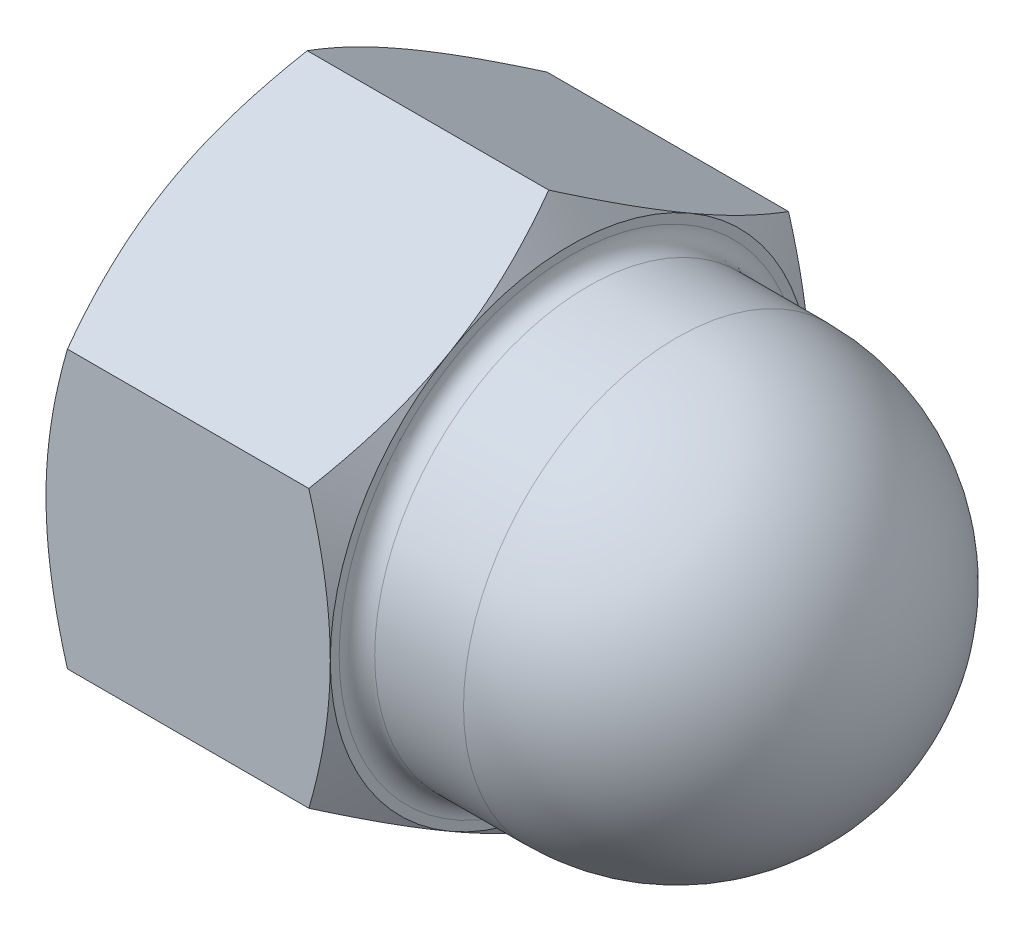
from build123d import *

# Parameters (mm, degrees)
BASENUT_DEPTH = 16
GRVSKE_W      = 7
GRVSKE_H      = 2.75
DOMEFILLET_R  = 1


with BuildPart() as part:
    # BaseNutSke → BaseNut (new body)
    with BuildSketch(Plane(origin=(0, 0, 0), x_dir=(0, 0, -1), z_dir=(1, 0, 0))):
        Polygon((13.5, 7.794228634), (13.5, -7.794228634), (0, -15.588457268), (-13.5, -7.794228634), (-13.5, 7.794228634), (0, 15.588457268), align=None)
    extrude(amount=BASENUT_DEPTH)

    # DomeSke → Dome (revolve)
    with BuildSketch(Plane.XY):
        with BuildLine():
            Line((34, 0), (0, 0))
            Line((0, 0), (0, 12))
            Line((0, 12), (22, 12))
            ThreePointArc((22, 12), (30.485281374, 8.485281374), (34, 0))
        make_face()
    revolve(axis=Axis((0, 0, 0), (1, 0, 0)))

    # Sketch4 → DoubleChamfer (revolve, cut)
    with BuildSketch(Plane.XY, mode=Mode.PRIVATE) as doublechamfer_sk:
        Polygon((0, 13.5), (2.504809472, 17.838457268), (13.495190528, 17.838457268), (16, 13.5), (18, 13.5), (18, 28.5), (-2, 28.5), (-2, 13.5), align=None)
    revolve(doublechamfer_sk.sketch.rotate(Axis((0, 0, 0), (1, 0, 0)), 90), axis=Axis((0, 0, 0), (1, 0, 0)), mode=Mode.SUBTRACT)

    # TapDriSke → TapDrill (revolve, cut)
    with BuildSketch(Plane.XY, mode=Mode.PRIVATE) as tapdrill_sk:
        Polygon((0, 8.75), (27, 8.75), (32.257530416, 0), (0, 0), align=None)
    revolve(tapdrill_sk.sketch.rotate(Axis((0, 0, 0), (1, 0, 0)), 90), axis=Axis((0, 0, 0), (1, 0, 0)), mode=Mode.SUBTRACT)

    # GrvSke → Groove (revolve, cut)
    with BuildSketch(Plane.XY, mode=Mode.PRIVATE) as groove_sk:
        with Locations((19.5, 9.125)):
            Rectangle(GRVSKE_W, GRVSKE_H)
    revolve(groove_sk.sketch.rotate(Axis((0, 0, 0), (1, 0, 0)), 90), axis=Axis((0, 0, 0), (1, 0, 0)), mode=Mode.SUBTRACT)

    # EndChamferSketch → EndChamfer (revolve, cut)
    with BuildSketch(Plane.XY, mode=Mode.PRIVATE) as endchamfer_sk:
        Polygon((-0.0254, 10), (0.0254, 10), (0.988185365, 8.625), (-0.0254, 8.625), align=None)
    revolve(endchamfer_sk.sketch.rotate(Axis((0, 0, 0), (-1, 0, 0)), 270), axis=Axis((0, 0, 0), (-1, 0, 0)), mode=Mode.SUBTRACT)

    # DomeFillet
    domefillet_edges = [part.edges().sort_by_distance(p)[0] for p in [
        (16, -12, 0),
    ]]
    fillet(domefillet_edges, radius=DOMEFILLET_R)


solid = part.part
